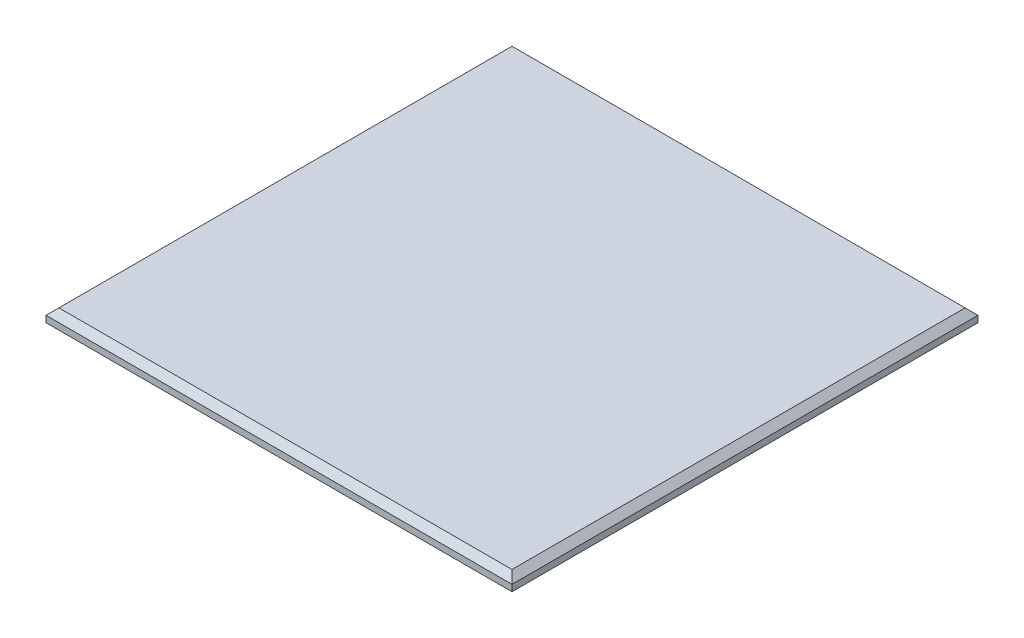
from build123d import *

# Parameters (mm, degrees)
SKETCH1_W          = 460
SKETCH1_H          = 460
BASE_EXTRUDE_DEPTH = 12.7
CHAMFER1_SIZE      = 6.35


with BuildPart() as part:
    # Sketch1 → Base-Extrude (new body)
    with BuildSketch(Plane(origin=(0, 0, 0), x_dir=(1, 0, 0), z_dir=(0, 1, 0))):
        Rectangle(SKETCH1_W, SKETCH1_H)
    extrude(amount=BASE_EXTRUDE_DEPTH)

    # Chamfer1
    chamfer1_edges = [part.edges().sort_by_distance(p)[0] for p in [
        (230, 12.7, 0),
        (0, 12.7, -230),
        (-230, 12.7, 0),
        (0, 12.7, 230),
    ]]
    chamfer(chamfer1_edges, length=CHAMFER1_SIZE)


solid = part.part
